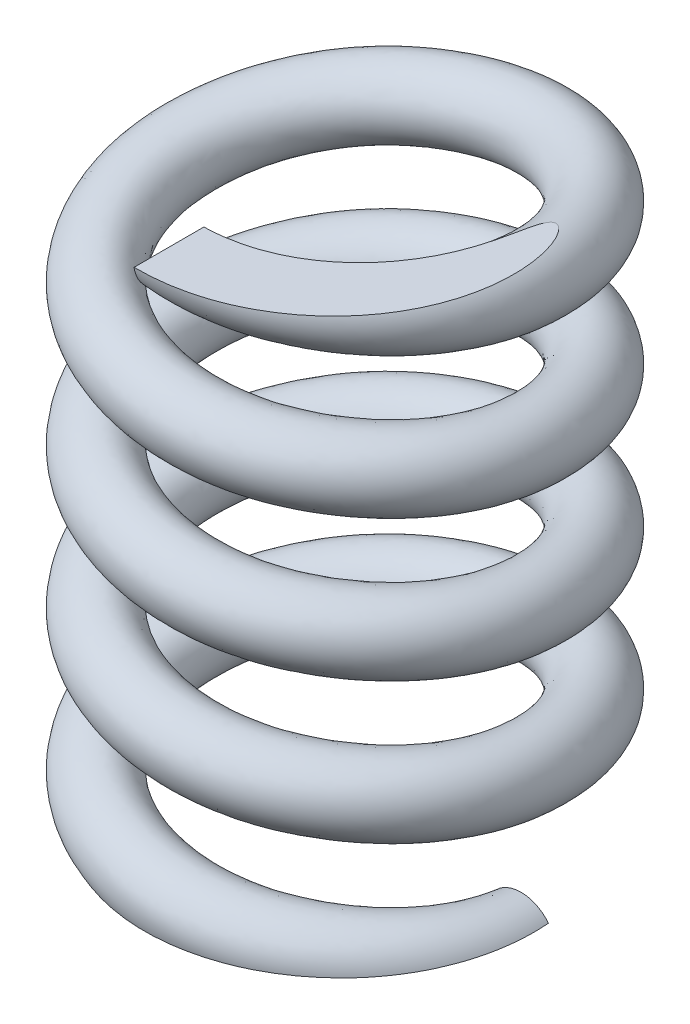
ISO-10303-21;
HEADER;
FILE_DESCRIPTION(('STEP AP214'),'2;1');
FILE_NAME('part.step','',(''),(''),'','','');
FILE_SCHEMA(('AUTOMOTIVE_DESIGN { 1 0 10303 214 1 1 1 1 }'));
ENDSEC;
DATA;
#1=APPLICATION_CONTEXT('core data for automotive mechanical design processes');
#2=APPLICATION_PROTOCOL_DEFINITION('international standard','automotive_design',2000,#1);
#3=PRODUCT_CONTEXT('',#1,'mechanical');
#4=PRODUCT('Part','Part','',(#3));
#5=PRODUCT_RELATED_PRODUCT_CATEGORY('part','',(#4));
#6=PRODUCT_DEFINITION_FORMATION('','',#4);
#7=PRODUCT_DEFINITION_CONTEXT('part definition',#1,'design');
#8=PRODUCT_DEFINITION('design','',#6,#7);
#9=PRODUCT_DEFINITION_SHAPE('','',#8);
#10=(LENGTH_UNIT() NAMED_UNIT(*) SI_UNIT(.MILLI.,.METRE.));
#11=(NAMED_UNIT(*) PLANE_ANGLE_UNIT() SI_UNIT($,.RADIAN.));
#12=(NAMED_UNIT(*) SI_UNIT($,.STERADIAN.) SOLID_ANGLE_UNIT());
#13=UNCERTAINTY_MEASURE_WITH_UNIT(LENGTH_MEASURE(1.E-05),#10,'distance_accuracy_value','');
#14=(GEOMETRIC_REPRESENTATION_CONTEXT(3) GLOBAL_UNCERTAINTY_ASSIGNED_CONTEXT((#13)) GLOBAL_UNIT_ASSIGNED_CONTEXT((#10,
#11,#12)) REPRESENTATION_CONTEXT('',''));
#15=CARTESIAN_POINT('',(0.,0.,0.));
#16=DIRECTION('',(0.,0.,1.));
#17=DIRECTION('',(1.,0.,0.));
#18=AXIS2_PLACEMENT_3D('',#15,#16,#17);
#19=CARTESIAN_POINT('',(2.5,0.,0.));
#20=DIRECTION('',(0.,0.,1.));
#21=DIRECTION('',(1.,0.,0.));
#22=AXIS2_PLACEMENT_3D('',#19,#20,#21);
#23=PLANE('',#22);
#24=CARTESIAN_POINT('',(2.5,0.,0.));
#25=DIRECTION('',(0.,0.,1.));
#26=DIRECTION('',(1.,0.,0.));
#27=AXIS2_PLACEMENT_3D('',#24,#25,#26);
#28=CIRCLE('',#27,0.5);
#29=CARTESIAN_POINT('',(2.88911017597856,0.313995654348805,0.));
#30=VERTEX_POINT('',#29);
#31=CARTESIAN_POINT('',(2.11088982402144,0.313995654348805,0.));
#32=VERTEX_POINT('',#31);
#33=EDGE_CURVE('E64',#30,#32,#28,.T.);
#34=ORIENTED_EDGE('',*,*,#33,.F.);
#35=DIRECTION('',(-1.,0.,0.));
#36=VECTOR('',#35,1.);
#37=CARTESIAN_POINT('',(2.5,0.313995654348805,0.));
#38=LINE('',#37,#36);
#39=EDGE_CURVE('E47',#30,#32,#38,.T.);
#40=ORIENTED_EDGE('',*,*,#39,.T.);
#41=EDGE_LOOP('',(#34,#40));
#42=FACE_BOUND('',#41,.T.);
#43=ADVANCED_FACE('F27',(#42),#23,.F.);
#44=CARTESIAN_POINT('',(-1.52828934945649E-13,8.5,2.5));
#45=DIRECTION('',(-1.,0.,0.));
#46=DIRECTION('',(0.,0.,1.));
#47=AXIS2_PLACEMENT_3D('',#44,#45,#46);
#48=PLANE('',#47);
#49=DIRECTION('',(0.,0.,1.));
#50=VECTOR('',#49,1.);
#51=CARTESIAN_POINT('',(-1.52828934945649E-13,8.43383346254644,2.5));
#52=LINE('',#51,#50);
#53=CARTESIAN_POINT('',(0.,8.43383346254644,2.00439734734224));
#54=VERTEX_POINT('',#53);
#55=CARTESIAN_POINT('',(-1.83125905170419E-13,8.43383346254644,2.99560265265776));
#56=VERTEX_POINT('',#55);
#57=EDGE_CURVE('E54',#54,#56,#52,.T.);
#58=ORIENTED_EDGE('',*,*,#57,.F.);
#59=CARTESIAN_POINT('',(-1.52828934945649E-13,8.5,2.5));
#60=DIRECTION('',(-1.,0.,0.));
#61=DIRECTION('',(0.,0.,1.));
#62=AXIS2_PLACEMENT_3D('',#59,#60,#61);
#63=CIRCLE('',#62,0.5);
#64=EDGE_CURVE('E67',#54,#56,#63,.T.);
#65=ORIENTED_EDGE('',*,*,#64,.T.);
#66=EDGE_LOOP('',(#58,#65));
#67=FACE_BOUND('',#66,.T.);
#68=ADVANCED_FACE('F82',(#67),#48,.T.);
#69=CARTESIAN_POINT('',(3.,0.,0.));
#70=CARTESIAN_POINT('',(3.,0.166666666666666,1.73205080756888));
#71=CARTESIAN_POINT('',(1.5,0.333333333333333,2.59807621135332));
#72=CARTESIAN_POINT('',(0.,0.499999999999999,3.46410161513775));
#73=CARTESIAN_POINT('',(-1.5,0.666666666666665,2.59807621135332));
#74=CARTESIAN_POINT('',(-3.,0.833333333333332,1.73205080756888));
#75=CARTESIAN_POINT('',(-3.,0.999999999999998,0.));
#76=CARTESIAN_POINT('',(-3.,1.16666666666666,-1.73205080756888));
#77=CARTESIAN_POINT('',(-1.5,1.33333333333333,-2.59807621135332));
#78=CARTESIAN_POINT('',(0.,1.5,-3.46410161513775));
#79=CARTESIAN_POINT('',(1.5,1.66666666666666,-2.59807621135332));
#80=CARTESIAN_POINT('',(3.,1.83333333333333,-1.73205080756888));
#81=CARTESIAN_POINT('',(3.,2.,0.));
#82=CARTESIAN_POINT('',(3.,2.16666666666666,1.73205080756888));
#83=CARTESIAN_POINT('',(1.5,2.33333333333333,2.59807621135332));
#84=CARTESIAN_POINT('',(0.,2.49999999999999,3.46410161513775));
#85=CARTESIAN_POINT('',(-1.5,2.66666666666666,2.59807621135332));
#86=CARTESIAN_POINT('',(-3.,2.83333333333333,1.73205080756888));
#87=CARTESIAN_POINT('',(-3.,2.99999999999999,0.));
#88=CARTESIAN_POINT('',(-3.,3.16666666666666,-1.73205080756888));
#89=CARTESIAN_POINT('',(-1.5,3.33333333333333,-2.59807621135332));
#90=CARTESIAN_POINT('',(0.,3.49999999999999,-3.46410161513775));
#91=CARTESIAN_POINT('',(1.5,3.66666666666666,-2.59807621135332));
#92=CARTESIAN_POINT('',(3.,3.83333333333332,-1.73205080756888));
#93=CARTESIAN_POINT('',(3.,3.99999999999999,0.));
#94=CARTESIAN_POINT('',(3.,4.16666666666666,1.73205080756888));
#95=CARTESIAN_POINT('',(1.5,4.33333333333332,2.59807621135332));
#96=CARTESIAN_POINT('',(0.,4.49999999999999,3.46410161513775));
#97=CARTESIAN_POINT('',(-1.5,4.66666666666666,2.59807621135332));
#98=CARTESIAN_POINT('',(-3.,4.83333333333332,1.73205080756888));
#99=CARTESIAN_POINT('',(-3.,4.99999999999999,0.));
#100=CARTESIAN_POINT('',(-3.,5.16666666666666,-1.73205080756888));
#101=CARTESIAN_POINT('',(-1.5,5.33333333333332,-2.59807621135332));
#102=CARTESIAN_POINT('',(0.,5.49999999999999,-3.46410161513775));
#103=CARTESIAN_POINT('',(1.5,5.66666666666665,-2.59807621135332));
#104=CARTESIAN_POINT('',(3.,5.83333333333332,-1.73205080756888));
#105=CARTESIAN_POINT('',(3.,5.99999999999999,0.));
#106=CARTESIAN_POINT('',(3.,6.16666666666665,1.73205080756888));
#107=CARTESIAN_POINT('',(1.5,6.33333333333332,2.59807621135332));
#108=CARTESIAN_POINT('',(0.,6.49999999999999,3.46410161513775));
#109=CARTESIAN_POINT('',(-1.5,6.66666666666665,2.59807621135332));
#110=CARTESIAN_POINT('',(-3.,6.83333333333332,1.73205080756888));
#111=CARTESIAN_POINT('',(-3.,6.99999999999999,0.));
#112=CARTESIAN_POINT('',(-3.,7.16666666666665,-1.73205080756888));
#113=CARTESIAN_POINT('',(-1.5,7.33333333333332,-2.59807621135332));
#114=CARTESIAN_POINT('',(0.,7.49999999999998,-3.46410161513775));
#115=CARTESIAN_POINT('',(1.5,7.66666666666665,-2.59807621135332));
#116=CARTESIAN_POINT('',(3.,7.83333333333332,-1.73205080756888));
#117=CARTESIAN_POINT('',(3.,7.99999999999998,0.));
#118=CARTESIAN_POINT('',(3.,8.16666666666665,1.73205080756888));
#119=CARTESIAN_POINT('',(1.5,8.33333333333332,2.59807621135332));
#120=CARTESIAN_POINT('',(0.,8.49999999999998,3.46410161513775));
#121=CARTESIAN_POINT('',(-1.5,8.66666666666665,2.59807621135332));
#122=CARTESIAN_POINT('',(-3.,8.83333333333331,1.73205080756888));
#123=CARTESIAN_POINT('',(-3.,8.99999999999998,0.));
#124=CARTESIAN_POINT('',(-3.,9.16666666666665,-1.73205080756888));
#125=CARTESIAN_POINT('',(-1.5,9.33333333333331,-2.59807621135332));
#126=CARTESIAN_POINT('',(0.,9.49999999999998,-3.46410161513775));
#127=CARTESIAN_POINT('',(1.5,9.66666666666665,-2.59807621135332));
#128=CARTESIAN_POINT('',(3.,9.83333333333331,-1.73205080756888));
#129=CARTESIAN_POINT('',(3.,9.99999999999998,0.));
#130=CARTESIAN_POINT('',(3.,1.,0.));
#131=CARTESIAN_POINT('',(3.,1.16666666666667,1.73205080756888));
#132=CARTESIAN_POINT('',(1.5,1.33333333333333,2.59807621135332));
#133=CARTESIAN_POINT('',(0.,1.5,3.46410161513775));
#134=CARTESIAN_POINT('',(-1.5,1.66666666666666,2.59807621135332));
#135=CARTESIAN_POINT('',(-3.,1.83333333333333,1.73205080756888));
#136=CARTESIAN_POINT('',(-3.,2.,0.));
#137=CARTESIAN_POINT('',(-3.,2.16666666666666,-1.73205080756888));
#138=CARTESIAN_POINT('',(-1.5,2.33333333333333,-2.59807621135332));
#139=CARTESIAN_POINT('',(0.,2.5,-3.46410161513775));
#140=CARTESIAN_POINT('',(1.5,2.66666666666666,-2.59807621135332));
#141=CARTESIAN_POINT('',(3.,2.83333333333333,-1.73205080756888));
#142=CARTESIAN_POINT('',(3.,3.,0.));
#143=CARTESIAN_POINT('',(3.,3.16666666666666,1.73205080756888));
#144=CARTESIAN_POINT('',(1.5,3.33333333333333,2.59807621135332));
#145=CARTESIAN_POINT('',(0.,3.49999999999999,3.46410161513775));
#146=CARTESIAN_POINT('',(-1.5,3.66666666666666,2.59807621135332));
#147=CARTESIAN_POINT('',(-3.,3.83333333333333,1.73205080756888));
#148=CARTESIAN_POINT('',(-3.,3.99999999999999,0.));
#149=CARTESIAN_POINT('',(-3.,4.16666666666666,-1.73205080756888));
#150=CARTESIAN_POINT('',(-1.5,4.33333333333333,-2.59807621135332));
#151=CARTESIAN_POINT('',(0.,4.49999999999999,-3.46410161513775));
#152=CARTESIAN_POINT('',(1.5,4.66666666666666,-2.59807621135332));
#153=CARTESIAN_POINT('',(3.,4.83333333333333,-1.73205080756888));
#154=CARTESIAN_POINT('',(3.,4.99999999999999,0.));
#155=CARTESIAN_POINT('',(3.,5.16666666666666,1.73205080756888));
#156=CARTESIAN_POINT('',(1.5,5.33333333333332,2.59807621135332));
#157=CARTESIAN_POINT('',(0.,5.49999999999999,3.46410161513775));
#158=CARTESIAN_POINT('',(-1.5,5.66666666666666,2.59807621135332));
#159=CARTESIAN_POINT('',(-3.,5.83333333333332,1.73205080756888));
#160=CARTESIAN_POINT('',(-3.,5.99999999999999,0.));
#161=CARTESIAN_POINT('',(-3.,6.16666666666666,-1.73205080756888));
#162=CARTESIAN_POINT('',(-1.5,6.33333333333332,-2.59807621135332));
#163=CARTESIAN_POINT('',(0.,6.49999999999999,-3.46410161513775));
#164=CARTESIAN_POINT('',(1.5,6.66666666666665,-2.59807621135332));
#165=CARTESIAN_POINT('',(3.,6.83333333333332,-1.73205080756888));
#166=CARTESIAN_POINT('',(3.,6.99999999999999,0.));
#167=CARTESIAN_POINT('',(3.,7.16666666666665,1.73205080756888));
#168=CARTESIAN_POINT('',(1.5,7.33333333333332,2.59807621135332));
#169=CARTESIAN_POINT('',(0.,7.49999999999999,3.46410161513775));
#170=CARTESIAN_POINT('',(-1.5,7.66666666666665,2.59807621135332));
#171=CARTESIAN_POINT('',(-3.,7.83333333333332,1.73205080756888));
#172=CARTESIAN_POINT('',(-3.,7.99999999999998,0.));
#173=CARTESIAN_POINT('',(-3.,8.16666666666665,-1.73205080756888));
#174=CARTESIAN_POINT('',(-1.5,8.33333333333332,-2.59807621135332));
#175=CARTESIAN_POINT('',(0.,8.49999999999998,-3.46410161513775));
#176=CARTESIAN_POINT('',(1.5,8.66666666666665,-2.59807621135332));
#177=CARTESIAN_POINT('',(3.,8.83333333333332,-1.73205080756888));
#178=CARTESIAN_POINT('',(3.,8.99999999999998,0.));
#179=CARTESIAN_POINT('',(3.,9.16666666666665,1.73205080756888));
#180=CARTESIAN_POINT('',(1.5,9.33333333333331,2.59807621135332));
#181=CARTESIAN_POINT('',(0.,9.49999999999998,3.46410161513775));
#182=CARTESIAN_POINT('',(-1.5,9.66666666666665,2.59807621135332));
#183=CARTESIAN_POINT('',(-3.,9.83333333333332,1.73205080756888));
#184=CARTESIAN_POINT('',(-3.,9.99999999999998,0.));
#185=CARTESIAN_POINT('',(-3.,10.1666666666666,-1.73205080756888));
#186=CARTESIAN_POINT('',(-1.5,10.3333333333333,-2.59807621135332));
#187=CARTESIAN_POINT('',(0.,10.5,-3.46410161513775));
#188=CARTESIAN_POINT('',(1.5,10.6666666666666,-2.59807621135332));
#189=CARTESIAN_POINT('',(3.,10.8333333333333,-1.73205080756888));
#190=CARTESIAN_POINT('',(3.,11.,0.));
#191=CARTESIAN_POINT('',(2.,1.,0.));
#192=CARTESIAN_POINT('',(2.,1.16666666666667,1.15470053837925));
#193=CARTESIAN_POINT('',(1.,1.33333333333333,1.73205080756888));
#194=CARTESIAN_POINT('',(0.,1.5,2.3094010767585));
#195=CARTESIAN_POINT('',(-1.,1.66666666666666,1.73205080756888));
#196=CARTESIAN_POINT('',(-2.,1.83333333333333,1.15470053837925));
#197=CARTESIAN_POINT('',(-2.,2.,0.));
#198=CARTESIAN_POINT('',(-2.,2.16666666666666,-1.15470053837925));
#199=CARTESIAN_POINT('',(-1.,2.33333333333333,-1.73205080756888));
#200=CARTESIAN_POINT('',(0.,2.5,-2.3094010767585));
#201=CARTESIAN_POINT('',(0.999999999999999,2.66666666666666,-1.73205080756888));
#202=CARTESIAN_POINT('',(2.,2.83333333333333,-1.15470053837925));
#203=CARTESIAN_POINT('',(2.,3.,0.));
#204=CARTESIAN_POINT('',(2.,3.16666666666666,1.15470053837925));
#205=CARTESIAN_POINT('',(1.,3.33333333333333,1.73205080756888));
#206=CARTESIAN_POINT('',(0.,3.49999999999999,2.3094010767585));
#207=CARTESIAN_POINT('',(-1.,3.66666666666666,1.73205080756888));
#208=CARTESIAN_POINT('',(-2.,3.83333333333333,1.15470053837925));
#209=CARTESIAN_POINT('',(-2.,3.99999999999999,0.));
#210=CARTESIAN_POINT('',(-2.,4.16666666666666,-1.15470053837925));
#211=CARTESIAN_POINT('',(-1.,4.33333333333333,-1.73205080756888));
#212=CARTESIAN_POINT('',(0.,4.49999999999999,-2.3094010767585));
#213=CARTESIAN_POINT('',(0.999999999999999,4.66666666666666,-1.73205080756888));
#214=CARTESIAN_POINT('',(2.,4.83333333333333,-1.15470053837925));
#215=CARTESIAN_POINT('',(2.,4.99999999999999,0.));
#216=CARTESIAN_POINT('',(2.,5.16666666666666,1.15470053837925));
#217=CARTESIAN_POINT('',(1.,5.33333333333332,1.73205080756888));
#218=CARTESIAN_POINT('',(0.,5.49999999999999,2.3094010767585));
#219=CARTESIAN_POINT('',(-1.,5.66666666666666,1.73205080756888));
#220=CARTESIAN_POINT('',(-2.,5.83333333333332,1.15470053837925));
#221=CARTESIAN_POINT('',(-2.,5.99999999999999,0.));
#222=CARTESIAN_POINT('',(-2.,6.16666666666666,-1.15470053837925));
#223=CARTESIAN_POINT('',(-1.,6.33333333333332,-1.73205080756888));
#224=CARTESIAN_POINT('',(0.,6.49999999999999,-2.3094010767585));
#225=CARTESIAN_POINT('',(0.999999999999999,6.66666666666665,-1.73205080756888));
#226=CARTESIAN_POINT('',(2.,6.83333333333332,-1.15470053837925));
#227=CARTESIAN_POINT('',(2.,6.99999999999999,0.));
#228=CARTESIAN_POINT('',(2.,7.16666666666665,1.15470053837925));
#229=CARTESIAN_POINT('',(1.,7.33333333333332,1.73205080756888));
#230=CARTESIAN_POINT('',(0.,7.49999999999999,2.3094010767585));
#231=CARTESIAN_POINT('',(-1.,7.66666666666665,1.73205080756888));
#232=CARTESIAN_POINT('',(-2.,7.83333333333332,1.15470053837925));
#233=CARTESIAN_POINT('',(-2.,7.99999999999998,0.));
#234=CARTESIAN_POINT('',(-2.,8.16666666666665,-1.15470053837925));
#235=CARTESIAN_POINT('',(-1.,8.33333333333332,-1.73205080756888));
#236=CARTESIAN_POINT('',(0.,8.49999999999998,-2.3094010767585));
#237=CARTESIAN_POINT('',(0.999999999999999,8.66666666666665,-1.73205080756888));
#238=CARTESIAN_POINT('',(2.,8.83333333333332,-1.15470053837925));
#239=CARTESIAN_POINT('',(2.,8.99999999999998,0.));
#240=CARTESIAN_POINT('',(2.,9.16666666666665,1.15470053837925));
#241=CARTESIAN_POINT('',(1.,9.33333333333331,1.73205080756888));
#242=CARTESIAN_POINT('',(0.,9.49999999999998,2.3094010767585));
#243=CARTESIAN_POINT('',(-1.,9.66666666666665,1.73205080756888));
#244=CARTESIAN_POINT('',(-2.,9.83333333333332,1.15470053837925));
#245=CARTESIAN_POINT('',(-2.,9.99999999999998,0.));
#246=CARTESIAN_POINT('',(-2.,10.1666666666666,-1.15470053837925));
#247=CARTESIAN_POINT('',(-1.,10.3333333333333,-1.73205080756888));
#248=CARTESIAN_POINT('',(0.,10.5,-2.3094010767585));
#249=CARTESIAN_POINT('',(0.999999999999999,10.6666666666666,-1.73205080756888));
#250=CARTESIAN_POINT('',(2.,10.8333333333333,-1.15470053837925));
#251=CARTESIAN_POINT('',(2.,11.,0.));
#252=CARTESIAN_POINT('',(2.,0.,0.));
#253=CARTESIAN_POINT('',(2.,0.166666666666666,1.15470053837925));
#254=CARTESIAN_POINT('',(1.,0.333333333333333,1.73205080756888));
#255=CARTESIAN_POINT('',(0.,0.499999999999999,2.3094010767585));
#256=CARTESIAN_POINT('',(-1.,0.666666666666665,1.73205080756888));
#257=CARTESIAN_POINT('',(-2.,0.833333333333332,1.15470053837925));
#258=CARTESIAN_POINT('',(-2.,0.999999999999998,0.));
#259=CARTESIAN_POINT('',(-2.,1.16666666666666,-1.15470053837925));
#260=CARTESIAN_POINT('',(-1.,1.33333333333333,-1.73205080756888));
#261=CARTESIAN_POINT('',(0.,1.5,-2.3094010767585));
#262=CARTESIAN_POINT('',(0.999999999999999,1.66666666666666,-1.73205080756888));
#263=CARTESIAN_POINT('',(2.,1.83333333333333,-1.15470053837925));
#264=CARTESIAN_POINT('',(2.,2.,0.));
#265=CARTESIAN_POINT('',(2.,2.16666666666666,1.15470053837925));
#266=CARTESIAN_POINT('',(1.,2.33333333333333,1.73205080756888));
#267=CARTESIAN_POINT('',(0.,2.49999999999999,2.3094010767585));
#268=CARTESIAN_POINT('',(-1.,2.66666666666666,1.73205080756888));
#269=CARTESIAN_POINT('',(-2.,2.83333333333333,1.15470053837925));
#270=CARTESIAN_POINT('',(-2.,2.99999999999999,0.));
#271=CARTESIAN_POINT('',(-2.,3.16666666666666,-1.15470053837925));
#272=CARTESIAN_POINT('',(-1.,3.33333333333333,-1.73205080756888));
#273=CARTESIAN_POINT('',(0.,3.49999999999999,-2.3094010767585));
#274=CARTESIAN_POINT('',(0.999999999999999,3.66666666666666,-1.73205080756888));
#275=CARTESIAN_POINT('',(2.,3.83333333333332,-1.15470053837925));
#276=CARTESIAN_POINT('',(2.,3.99999999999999,0.));
#277=CARTESIAN_POINT('',(2.,4.16666666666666,1.15470053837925));
#278=CARTESIAN_POINT('',(1.,4.33333333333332,1.73205080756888));
#279=CARTESIAN_POINT('',(0.,4.49999999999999,2.3094010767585));
#280=CARTESIAN_POINT('',(-1.,4.66666666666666,1.73205080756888));
#281=CARTESIAN_POINT('',(-2.,4.83333333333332,1.15470053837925));
#282=CARTESIAN_POINT('',(-2.,4.99999999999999,0.));
#283=CARTESIAN_POINT('',(-2.,5.16666666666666,-1.15470053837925));
#284=CARTESIAN_POINT('',(-1.,5.33333333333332,-1.73205080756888));
#285=CARTESIAN_POINT('',(0.,5.49999999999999,-2.3094010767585));
#286=CARTESIAN_POINT('',(0.999999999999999,5.66666666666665,-1.73205080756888));
#287=CARTESIAN_POINT('',(2.,5.83333333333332,-1.15470053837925));
#288=CARTESIAN_POINT('',(2.,5.99999999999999,0.));
#289=CARTESIAN_POINT('',(2.,6.16666666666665,1.15470053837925));
#290=CARTESIAN_POINT('',(1.,6.33333333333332,1.73205080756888));
#291=CARTESIAN_POINT('',(0.,6.49999999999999,2.3094010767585));
#292=CARTESIAN_POINT('',(-1.,6.66666666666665,1.73205080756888));
#293=CARTESIAN_POINT('',(-2.,6.83333333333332,1.15470053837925));
#294=CARTESIAN_POINT('',(-2.,6.99999999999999,0.));
#295=CARTESIAN_POINT('',(-2.,7.16666666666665,-1.15470053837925));
#296=CARTESIAN_POINT('',(-1.,7.33333333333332,-1.73205080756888));
#297=CARTESIAN_POINT('',(0.,7.49999999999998,-2.3094010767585));
#298=CARTESIAN_POINT('',(0.999999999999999,7.66666666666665,-1.73205080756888));
#299=CARTESIAN_POINT('',(2.,7.83333333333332,-1.15470053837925));
#300=CARTESIAN_POINT('',(2.,7.99999999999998,0.));
#301=CARTESIAN_POINT('',(2.,8.16666666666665,1.15470053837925));
#302=CARTESIAN_POINT('',(1.,8.33333333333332,1.73205080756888));
#303=CARTESIAN_POINT('',(0.,8.49999999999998,2.3094010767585));
#304=CARTESIAN_POINT('',(-1.,8.66666666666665,1.73205080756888));
#305=CARTESIAN_POINT('',(-2.,8.83333333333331,1.15470053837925));
#306=CARTESIAN_POINT('',(-2.,8.99999999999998,0.));
#307=CARTESIAN_POINT('',(-2.,9.16666666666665,-1.15470053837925));
#308=CARTESIAN_POINT('',(-1.,9.33333333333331,-1.73205080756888));
#309=CARTESIAN_POINT('',(0.,9.49999999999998,-2.3094010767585));
#310=CARTESIAN_POINT('',(0.999999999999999,9.66666666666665,-1.73205080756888));
#311=CARTESIAN_POINT('',(2.,9.83333333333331,-1.15470053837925));
#312=CARTESIAN_POINT('',(2.,9.99999999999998,0.));
#313=CARTESIAN_POINT('',(2.,-1.,0.));
#314=CARTESIAN_POINT('',(2.,-0.833333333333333,1.15470053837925));
#315=CARTESIAN_POINT('',(1.,-0.666666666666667,1.73205080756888));
#316=CARTESIAN_POINT('',(0.,-0.500000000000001,2.3094010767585));
#317=CARTESIAN_POINT('',(-1.,-0.333333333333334,1.73205080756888));
#318=CARTESIAN_POINT('',(-2.,-0.166666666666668,1.15470053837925));
#319=CARTESIAN_POINT('',(-2.,0.,0.));
#320=CARTESIAN_POINT('',(-2.,0.166666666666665,-1.15470053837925));
#321=CARTESIAN_POINT('',(-1.,0.333333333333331,-1.73205080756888));
#322=CARTESIAN_POINT('',(0.,0.499999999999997,-2.3094010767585));
#323=CARTESIAN_POINT('',(0.999999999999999,0.666666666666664,-1.73205080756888));
#324=CARTESIAN_POINT('',(2.,0.83333333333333,-1.15470053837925));
#325=CARTESIAN_POINT('',(2.,0.999999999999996,0.));
#326=CARTESIAN_POINT('',(2.,1.16666666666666,1.15470053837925));
#327=CARTESIAN_POINT('',(1.,1.33333333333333,1.73205080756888));
#328=CARTESIAN_POINT('',(0.,1.5,2.3094010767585));
#329=CARTESIAN_POINT('',(-1.,1.66666666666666,1.73205080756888));
#330=CARTESIAN_POINT('',(-2.,1.83333333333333,1.15470053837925));
#331=CARTESIAN_POINT('',(-2.,1.99999999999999,0.));
#332=CARTESIAN_POINT('',(-2.,2.16666666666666,-1.15470053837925));
#333=CARTESIAN_POINT('',(-1.,2.33333333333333,-1.73205080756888));
#334=CARTESIAN_POINT('',(0.,2.49999999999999,-2.3094010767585));
#335=CARTESIAN_POINT('',(0.999999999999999,2.66666666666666,-1.73205080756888));
#336=CARTESIAN_POINT('',(2.,2.83333333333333,-1.15470053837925));
#337=CARTESIAN_POINT('',(2.,2.99999999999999,0.));
#338=CARTESIAN_POINT('',(2.,3.16666666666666,1.15470053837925));
#339=CARTESIAN_POINT('',(1.,3.33333333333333,1.73205080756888));
#340=CARTESIAN_POINT('',(0.,3.49999999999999,2.3094010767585));
#341=CARTESIAN_POINT('',(-1.,3.66666666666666,1.73205080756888));
#342=CARTESIAN_POINT('',(-2.,3.83333333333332,1.15470053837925));
#343=CARTESIAN_POINT('',(-2.,3.99999999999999,0.));
#344=CARTESIAN_POINT('',(-2.,4.16666666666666,-1.15470053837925));
#345=CARTESIAN_POINT('',(-1.,4.33333333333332,-1.73205080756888));
#346=CARTESIAN_POINT('',(0.,4.49999999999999,-2.3094010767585));
#347=CARTESIAN_POINT('',(0.999999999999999,4.66666666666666,-1.73205080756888));
#348=CARTESIAN_POINT('',(2.,4.83333333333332,-1.15470053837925));
#349=CARTESIAN_POINT('',(2.,4.99999999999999,0.));
#350=CARTESIAN_POINT('',(2.,5.16666666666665,1.15470053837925));
#351=CARTESIAN_POINT('',(1.,5.33333333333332,1.73205080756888));
#352=CARTESIAN_POINT('',(0.,5.49999999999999,2.3094010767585));
#353=CARTESIAN_POINT('',(-1.,5.66666666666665,1.73205080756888));
#354=CARTESIAN_POINT('',(-2.,5.83333333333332,1.15470053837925));
#355=CARTESIAN_POINT('',(-2.,5.99999999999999,0.));
#356=CARTESIAN_POINT('',(-2.,6.16666666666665,-1.15470053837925));
#357=CARTESIAN_POINT('',(-1.,6.33333333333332,-1.73205080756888));
#358=CARTESIAN_POINT('',(0.,6.49999999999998,-2.3094010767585));
#359=CARTESIAN_POINT('',(0.999999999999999,6.66666666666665,-1.73205080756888));
#360=CARTESIAN_POINT('',(2.,6.83333333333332,-1.15470053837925));
#361=CARTESIAN_POINT('',(2.,6.99999999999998,0.));
#362=CARTESIAN_POINT('',(2.,7.16666666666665,1.15470053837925));
#363=CARTESIAN_POINT('',(1.,7.33333333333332,1.73205080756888));
#364=CARTESIAN_POINT('',(0.,7.49999999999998,2.3094010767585));
#365=CARTESIAN_POINT('',(-1.,7.66666666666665,1.73205080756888));
#366=CARTESIAN_POINT('',(-2.,7.83333333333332,1.15470053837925));
#367=CARTESIAN_POINT('',(-2.,7.99999999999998,0.));
#368=CARTESIAN_POINT('',(-2.,8.16666666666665,-1.15470053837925));
#369=CARTESIAN_POINT('',(-1.,8.33333333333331,-1.73205080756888));
#370=CARTESIAN_POINT('',(0.,8.49999999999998,-2.3094010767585));
#371=CARTESIAN_POINT('',(0.999999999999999,8.66666666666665,-1.73205080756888));
#372=CARTESIAN_POINT('',(2.,8.83333333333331,-1.15470053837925));
#373=CARTESIAN_POINT('',(2.,8.99999999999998,0.));
#374=CARTESIAN_POINT('',(3.,-1.,0.));
#375=CARTESIAN_POINT('',(3.,-0.833333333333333,1.73205080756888));
#376=CARTESIAN_POINT('',(1.5,-0.666666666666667,2.59807621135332));
#377=CARTESIAN_POINT('',(0.,-0.500000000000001,3.46410161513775));
#378=CARTESIAN_POINT('',(-1.5,-0.333333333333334,2.59807621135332));
#379=CARTESIAN_POINT('',(-3.,-0.166666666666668,1.73205080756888));
#380=CARTESIAN_POINT('',(-3.,0.,0.));
#381=CARTESIAN_POINT('',(-3.,0.166666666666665,-1.73205080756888));
#382=CARTESIAN_POINT('',(-1.5,0.333333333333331,-2.59807621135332));
#383=CARTESIAN_POINT('',(0.,0.499999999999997,-3.46410161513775));
#384=CARTESIAN_POINT('',(1.5,0.666666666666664,-2.59807621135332));
#385=CARTESIAN_POINT('',(3.,0.83333333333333,-1.73205080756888));
#386=CARTESIAN_POINT('',(3.,0.999999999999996,0.));
#387=CARTESIAN_POINT('',(3.,1.16666666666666,1.73205080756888));
#388=CARTESIAN_POINT('',(1.5,1.33333333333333,2.59807621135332));
#389=CARTESIAN_POINT('',(0.,1.5,3.46410161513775));
#390=CARTESIAN_POINT('',(-1.5,1.66666666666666,2.59807621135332));
#391=CARTESIAN_POINT('',(-3.,1.83333333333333,1.73205080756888));
#392=CARTESIAN_POINT('',(-3.,1.99999999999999,0.));
#393=CARTESIAN_POINT('',(-3.,2.16666666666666,-1.73205080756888));
#394=CARTESIAN_POINT('',(-1.5,2.33333333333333,-2.59807621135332));
#395=CARTESIAN_POINT('',(0.,2.49999999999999,-3.46410161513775));
#396=CARTESIAN_POINT('',(1.5,2.66666666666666,-2.59807621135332));
#397=CARTESIAN_POINT('',(3.,2.83333333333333,-1.73205080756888));
#398=CARTESIAN_POINT('',(3.,2.99999999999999,0.));
#399=CARTESIAN_POINT('',(3.,3.16666666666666,1.73205080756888));
#400=CARTESIAN_POINT('',(1.5,3.33333333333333,2.59807621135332));
#401=CARTESIAN_POINT('',(0.,3.49999999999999,3.46410161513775));
#402=CARTESIAN_POINT('',(-1.5,3.66666666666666,2.59807621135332));
#403=CARTESIAN_POINT('',(-3.,3.83333333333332,1.73205080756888));
#404=CARTESIAN_POINT('',(-3.,3.99999999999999,0.));
#405=CARTESIAN_POINT('',(-3.,4.16666666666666,-1.73205080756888));
#406=CARTESIAN_POINT('',(-1.5,4.33333333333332,-2.59807621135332));
#407=CARTESIAN_POINT('',(0.,4.49999999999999,-3.46410161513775));
#408=CARTESIAN_POINT('',(1.5,4.66666666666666,-2.59807621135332));
#409=CARTESIAN_POINT('',(3.,4.83333333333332,-1.73205080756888));
#410=CARTESIAN_POINT('',(3.,4.99999999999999,0.));
#411=CARTESIAN_POINT('',(3.,5.16666666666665,1.73205080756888));
#412=CARTESIAN_POINT('',(1.5,5.33333333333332,2.59807621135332));
#413=CARTESIAN_POINT('',(0.,5.49999999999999,3.46410161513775));
#414=CARTESIAN_POINT('',(-1.5,5.66666666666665,2.59807621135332));
#415=CARTESIAN_POINT('',(-3.,5.83333333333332,1.73205080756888));
#416=CARTESIAN_POINT('',(-3.,5.99999999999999,0.));
#417=CARTESIAN_POINT('',(-3.,6.16666666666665,-1.73205080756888));
#418=CARTESIAN_POINT('',(-1.5,6.33333333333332,-2.59807621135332));
#419=CARTESIAN_POINT('',(0.,6.49999999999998,-3.46410161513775));
#420=CARTESIAN_POINT('',(1.5,6.66666666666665,-2.59807621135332));
#421=CARTESIAN_POINT('',(3.,6.83333333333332,-1.73205080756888));
#422=CARTESIAN_POINT('',(3.,6.99999999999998,0.));
#423=CARTESIAN_POINT('',(3.,7.16666666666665,1.73205080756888));
#424=CARTESIAN_POINT('',(1.5,7.33333333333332,2.59807621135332));
#425=CARTESIAN_POINT('',(0.,7.49999999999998,3.46410161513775));
#426=CARTESIAN_POINT('',(-1.5,7.66666666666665,2.59807621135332));
#427=CARTESIAN_POINT('',(-3.,7.83333333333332,1.73205080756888));
#428=CARTESIAN_POINT('',(-3.,7.99999999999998,0.));
#429=CARTESIAN_POINT('',(-3.,8.16666666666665,-1.73205080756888));
#430=CARTESIAN_POINT('',(-1.5,8.33333333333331,-2.59807621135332));
#431=CARTESIAN_POINT('',(0.,8.49999999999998,-3.46410161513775));
#432=CARTESIAN_POINT('',(1.5,8.66666666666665,-2.59807621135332));
#433=CARTESIAN_POINT('',(3.,8.83333333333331,-1.73205080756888));
#434=CARTESIAN_POINT('',(3.,8.99999999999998,0.));
#435=CARTESIAN_POINT('',(3.,0.,0.));
#436=CARTESIAN_POINT('',(3.,0.166666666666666,1.73205080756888));
#437=CARTESIAN_POINT('',(1.5,0.333333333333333,2.59807621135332));
#438=CARTESIAN_POINT('',(0.,0.499999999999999,3.46410161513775));
#439=CARTESIAN_POINT('',(-1.5,0.666666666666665,2.59807621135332));
#440=CARTESIAN_POINT('',(-3.,0.833333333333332,1.73205080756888));
#441=CARTESIAN_POINT('',(-3.,0.999999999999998,0.));
#442=CARTESIAN_POINT('',(-3.,1.16666666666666,-1.73205080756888));
#443=CARTESIAN_POINT('',(-1.5,1.33333333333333,-2.59807621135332));
#444=CARTESIAN_POINT('',(0.,1.5,-3.46410161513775));
#445=CARTESIAN_POINT('',(1.5,1.66666666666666,-2.59807621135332));
#446=CARTESIAN_POINT('',(3.,1.83333333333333,-1.73205080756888));
#447=CARTESIAN_POINT('',(3.,2.,0.));
#448=CARTESIAN_POINT('',(3.,2.16666666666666,1.73205080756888));
#449=CARTESIAN_POINT('',(1.5,2.33333333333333,2.59807621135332));
#450=CARTESIAN_POINT('',(0.,2.49999999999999,3.46410161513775));
#451=CARTESIAN_POINT('',(-1.5,2.66666666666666,2.59807621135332));
#452=CARTESIAN_POINT('',(-3.,2.83333333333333,1.73205080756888));
#453=CARTESIAN_POINT('',(-3.,2.99999999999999,0.));
#454=CARTESIAN_POINT('',(-3.,3.16666666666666,-1.73205080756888));
#455=CARTESIAN_POINT('',(-1.5,3.33333333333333,-2.59807621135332));
#456=CARTESIAN_POINT('',(0.,3.49999999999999,-3.46410161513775));
#457=CARTESIAN_POINT('',(1.5,3.66666666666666,-2.59807621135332));
#458=CARTESIAN_POINT('',(3.,3.83333333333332,-1.73205080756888));
#459=CARTESIAN_POINT('',(3.,3.99999999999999,0.));
#460=CARTESIAN_POINT('',(3.,4.16666666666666,1.73205080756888));
#461=CARTESIAN_POINT('',(1.5,4.33333333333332,2.59807621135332));
#462=CARTESIAN_POINT('',(0.,4.49999999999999,3.46410161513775));
#463=CARTESIAN_POINT('',(-1.5,4.66666666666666,2.59807621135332));
#464=CARTESIAN_POINT('',(-3.,4.83333333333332,1.73205080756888));
#465=CARTESIAN_POINT('',(-3.,4.99999999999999,0.));
#466=CARTESIAN_POINT('',(-3.,5.16666666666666,-1.73205080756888));
#467=CARTESIAN_POINT('',(-1.5,5.33333333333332,-2.59807621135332));
#468=CARTESIAN_POINT('',(0.,5.49999999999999,-3.46410161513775));
#469=CARTESIAN_POINT('',(1.5,5.66666666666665,-2.59807621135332));
#470=CARTESIAN_POINT('',(3.,5.83333333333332,-1.73205080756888));
#471=CARTESIAN_POINT('',(3.,5.99999999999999,0.));
#472=CARTESIAN_POINT('',(3.,6.16666666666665,1.73205080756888));
#473=CARTESIAN_POINT('',(1.5,6.33333333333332,2.59807621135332));
#474=CARTESIAN_POINT('',(0.,6.49999999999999,3.46410161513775));
#475=CARTESIAN_POINT('',(-1.5,6.66666666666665,2.59807621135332));
#476=CARTESIAN_POINT('',(-3.,6.83333333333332,1.73205080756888));
#477=CARTESIAN_POINT('',(-3.,6.99999999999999,0.));
#478=CARTESIAN_POINT('',(-3.,7.16666666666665,-1.73205080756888));
#479=CARTESIAN_POINT('',(-1.5,7.33333333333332,-2.59807621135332));
#480=CARTESIAN_POINT('',(0.,7.49999999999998,-3.46410161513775));
#481=CARTESIAN_POINT('',(1.5,7.66666666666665,-2.59807621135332));
#482=CARTESIAN_POINT('',(3.,7.83333333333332,-1.73205080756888));
#483=CARTESIAN_POINT('',(3.,7.99999999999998,0.));
#484=CARTESIAN_POINT('',(3.,8.16666666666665,1.73205080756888));
#485=CARTESIAN_POINT('',(1.5,8.33333333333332,2.59807621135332));
#486=CARTESIAN_POINT('',(0.,8.49999999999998,3.46410161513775));
#487=CARTESIAN_POINT('',(-1.5,8.66666666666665,2.59807621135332));
#488=CARTESIAN_POINT('',(-3.,8.83333333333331,1.73205080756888));
#489=CARTESIAN_POINT('',(-3.,8.99999999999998,0.));
#490=CARTESIAN_POINT('',(-3.,9.16666666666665,-1.73205080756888));
#491=CARTESIAN_POINT('',(-1.5,9.33333333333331,-2.59807621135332));
#492=CARTESIAN_POINT('',(0.,9.49999999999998,-3.46410161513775));
#493=CARTESIAN_POINT('',(1.5,9.66666666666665,-2.59807621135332));
#494=CARTESIAN_POINT('',(3.,9.83333333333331,-1.73205080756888));
#495=CARTESIAN_POINT('',(3.,9.99999999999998,0.));
#496=(BOUNDED_SURFACE() B_SPLINE_SURFACE(3,2,((#69,#70,#71,#72,#73,#74,#75,#76,#77,#78,#79,#80,
#81,#82,#83,#84,#85,#86,#87,#88,#89,#90,#91,#92,#93,#94,#95,#96,#97,#98,#99,#100,#101,#102,#103,
#104,#105,#106,#107,#108,#109,#110,#111,#112,#113,#114,#115,#116,#117,#118,#119,#120,#121,#122,
#123,#124,#125,#126,#127,#128,#129),(#130,#131,#132,#133,#134,#135,#136,#137,#138,#139,#140,
#141,#142,#143,#144,#145,#146,#147,#148,#149,#150,#151,#152,#153,#154,#155,#156,#157,#158,#159,
#160,#161,#162,#163,#164,#165,#166,#167,#168,#169,#170,#171,#172,#173,#174,#175,#176,#177,#178,
#179,#180,#181,#182,#183,#184,#185,#186,#187,#188,#189,#190),(#191,#192,#193,#194,#195,#196,
#197,#198,#199,#200,#201,#202,#203,#204,#205,#206,#207,#208,#209,#210,#211,#212,#213,#214,#215,
#216,#217,#218,#219,#220,#221,#222,#223,#224,#225,#226,#227,#228,#229,#230,#231,#232,#233,#234,
#235,#236,#237,#238,#239,#240,#241,#242,#243,#244,#245,#246,#247,#248,#249,#250,#251),(#252,
#253,#254,#255,#256,#257,#258,#259,#260,#261,#262,#263,#264,#265,#266,#267,#268,#269,#270,#271,
#272,#273,#274,#275,#276,#277,#278,#279,#280,#281,#282,#283,#284,#285,#286,#287,#288,#289,#290,
#291,#292,#293,#294,#295,#296,#297,#298,#299,#300,#301,#302,#303,#304,#305,#306,#307,#308,#309,
#310,#311,#312),(#313,#314,#315,#316,#317,#318,#319,#320,#321,#322,#323,#324,#325,#326,#327,
#328,#329,#330,#331,#332,#333,#334,#335,#336,#337,#338,#339,#340,#341,#342,#343,#344,#345,#346,
#347,#348,#349,#350,#351,#352,#353,#354,#355,#356,#357,#358,#359,#360,#361,#362,#363,#364,#365,
#366,#367,#368,#369,#370,#371,#372,#373),(#374,#375,#376,#377,#378,#379,#380,#381,#382,#383,
#384,#385,#386,#387,#388,#389,#390,#391,#392,#393,#394,#395,#396,#397,#398,#399,#400,#401,#402,
#403,#404,#405,#406,#407,#408,#409,#410,#411,#412,#413,#414,#415,#416,#417,#418,#419,#420,#421,
#422,#423,#424,#425,#426,#427,#428,#429,#430,#431,#432,#433,#434),(#435,#436,#437,#438,#439,
#440,#441,#442,#443,#444,#445,#446,#447,#448,#449,#450,#451,#452,#453,#454,#455,#456,#457,#458,
#459,#460,#461,#462,#463,#464,#465,#466,#467,#468,#469,#470,#471,#472,#473,#474,#475,#476,#477,
#478,#479,#480,#481,#482,#483,#484,#485,#486,#487,#488,#489,#490,#491,#492,#493,#494,#495)),
.UNSPECIFIED.,.T.,.F.,.F.) B_SPLINE_SURFACE_WITH_KNOTS((4,3,4),(3,2,2,2,2,2,2,2,2,2,2,2,2,2,2,2,
2,2,2,2,2,2,2,2,2,2,2,2,2,2,3),(0.,0.5,1.),(0.,0.0333333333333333,0.0666666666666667,0.1,
0.133333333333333,0.166666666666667,0.2,0.233333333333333,0.266666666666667,0.3,
0.333333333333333,0.366666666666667,0.4,0.433333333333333,0.466666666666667,0.5,
0.533333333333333,0.566666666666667,0.6,0.633333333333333,0.666666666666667,0.7,
0.733333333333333,0.766666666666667,0.8,0.833333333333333,0.866666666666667,0.9,
0.933333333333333,0.966666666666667,1.),
.UNSPECIFIED.) GEOMETRIC_REPRESENTATION_ITEM() RATIONAL_B_SPLINE_SURFACE(((1.,0.866025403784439,
1.,0.866025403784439,1.,0.866025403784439,1.,0.866025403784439,1.,0.866025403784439,1.,
0.866025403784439,1.,0.866025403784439,1.,0.866025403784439,1.,0.866025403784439,1.,
0.866025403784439,1.,0.866025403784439,1.,0.866025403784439,1.,0.866025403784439,1.,
0.866025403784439,1.,0.866025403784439,1.,0.866025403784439,1.,0.866025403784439,1.,
0.866025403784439,1.,0.866025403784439,1.,0.866025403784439,1.,0.866025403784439,1.,
0.866025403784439,1.,0.866025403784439,1.,0.866025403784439,1.,0.866025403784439,1.,
0.866025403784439,1.,0.866025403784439,1.,0.866025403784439,1.,0.866025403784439,1.,
0.866025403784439,1.),(0.333333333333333,0.288675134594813,0.333333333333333,0.288675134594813,
0.333333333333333,0.288675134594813,0.333333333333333,0.288675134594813,0.333333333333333,
0.288675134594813,0.333333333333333,0.288675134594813,0.333333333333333,0.288675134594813,
0.333333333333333,0.288675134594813,0.333333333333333,0.288675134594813,0.333333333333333,
0.288675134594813,0.333333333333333,0.288675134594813,0.333333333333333,0.288675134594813,
0.333333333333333,0.288675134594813,0.333333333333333,0.288675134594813,0.333333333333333,
0.288675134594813,0.333333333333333,0.288675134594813,0.333333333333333,0.288675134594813,
0.333333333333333,0.288675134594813,0.333333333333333,0.288675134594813,0.333333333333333,
0.288675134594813,0.333333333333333,0.288675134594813,0.333333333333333,0.288675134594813,
0.333333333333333,0.288675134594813,0.333333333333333,0.288675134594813,0.333333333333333,
0.288675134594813,0.333333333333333,0.288675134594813,0.333333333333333,0.288675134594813,
0.333333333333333,0.288675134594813,0.333333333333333,0.288675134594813,0.333333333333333,
0.288675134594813,0.333333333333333),(0.333333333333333,0.288675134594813,0.333333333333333,
0.288675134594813,0.333333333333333,0.288675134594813,0.333333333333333,0.288675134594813,
0.333333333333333,0.288675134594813,0.333333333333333,0.288675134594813,0.333333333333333,
0.288675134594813,0.333333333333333,0.288675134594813,0.333333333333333,0.288675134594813,
0.333333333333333,0.288675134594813,0.333333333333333,0.288675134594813,0.333333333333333,
0.288675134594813,0.333333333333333,0.288675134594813,0.333333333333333,0.288675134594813,
0.333333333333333,0.288675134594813,0.333333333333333,0.288675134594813,0.333333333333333,
0.288675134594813,0.333333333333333,0.288675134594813,0.333333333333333,0.288675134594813,
0.333333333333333,0.288675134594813,0.333333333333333,0.288675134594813,0.333333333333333,
0.288675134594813,0.333333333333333,0.288675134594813,0.333333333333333,0.288675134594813,
0.333333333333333,0.288675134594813,0.333333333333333,0.288675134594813,0.333333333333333,
0.288675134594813,0.333333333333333,0.288675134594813,0.333333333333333,0.288675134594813,
0.333333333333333,0.288675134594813,0.333333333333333),(1.,0.866025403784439,1.,
0.866025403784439,1.,0.866025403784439,1.,0.866025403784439,1.,0.866025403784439,1.,
0.866025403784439,1.,0.866025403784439,1.,0.866025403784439,1.,0.866025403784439,1.,
0.866025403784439,1.,0.866025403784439,1.,0.866025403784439,1.,0.866025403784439,1.,
0.866025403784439,1.,0.866025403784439,1.,0.866025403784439,1.,0.866025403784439,1.,
0.866025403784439,1.,0.866025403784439,1.,0.866025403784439,1.,0.866025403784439,1.,
0.866025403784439,1.,0.866025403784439,1.,0.866025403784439,1.,0.866025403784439,1.,
0.866025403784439,1.,0.866025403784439,1.,0.866025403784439,1.,0.866025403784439,1.,
0.866025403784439,1.),(0.333333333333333,0.288675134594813,0.333333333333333,0.288675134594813,
0.333333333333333,0.288675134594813,0.333333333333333,0.288675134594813,0.333333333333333,
0.288675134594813,0.333333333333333,0.288675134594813,0.333333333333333,0.288675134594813,
0.333333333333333,0.288675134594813,0.333333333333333,0.288675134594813,0.333333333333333,
0.288675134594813,0.333333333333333,0.288675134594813,0.333333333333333,0.288675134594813,
0.333333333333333,0.288675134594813,0.333333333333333,0.288675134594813,0.333333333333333,
0.288675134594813,0.333333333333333,0.288675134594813,0.333333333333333,0.288675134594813,
0.333333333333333,0.288675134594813,0.333333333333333,0.288675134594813,0.333333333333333,
0.288675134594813,0.333333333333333,0.288675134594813,0.333333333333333,0.288675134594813,
0.333333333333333,0.288675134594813,0.333333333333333,0.288675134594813,0.333333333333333,
0.288675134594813,0.333333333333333,0.288675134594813,0.333333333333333,0.288675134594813,
0.333333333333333,0.288675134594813,0.333333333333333,0.288675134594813,0.333333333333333,
0.288675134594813,0.333333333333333),(0.333333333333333,0.288675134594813,0.333333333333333,
0.288675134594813,0.333333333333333,0.288675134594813,0.333333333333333,0.288675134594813,
0.333333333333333,0.288675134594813,0.333333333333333,0.288675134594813,0.333333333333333,
0.288675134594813,0.333333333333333,0.288675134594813,0.333333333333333,0.288675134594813,
0.333333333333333,0.288675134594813,0.333333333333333,0.288675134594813,0.333333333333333,
0.288675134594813,0.333333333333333,0.288675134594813,0.333333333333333,0.288675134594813,
0.333333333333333,0.288675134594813,0.333333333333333,0.288675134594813,0.333333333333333,
0.288675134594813,0.333333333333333,0.288675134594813,0.333333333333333,0.288675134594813,
0.333333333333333,0.288675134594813,0.333333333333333,0.288675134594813,0.333333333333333,
0.288675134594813,0.333333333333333,0.288675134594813,0.333333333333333,0.288675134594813,
0.333333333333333,0.288675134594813,0.333333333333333,0.288675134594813,0.333333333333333,
0.288675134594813,0.333333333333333,0.288675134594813,0.333333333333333,0.288675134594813,
0.333333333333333,0.288675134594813,0.333333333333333),(1.,0.866025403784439,1.,
0.866025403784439,1.,0.866025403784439,1.,0.866025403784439,1.,0.866025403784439,1.,
0.866025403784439,1.,0.866025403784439,1.,0.866025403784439,1.,0.866025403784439,1.,
0.866025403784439,1.,0.866025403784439,1.,0.866025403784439,1.,0.866025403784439,1.,
0.866025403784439,1.,0.866025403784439,1.,0.866025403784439,1.,0.866025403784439,1.,
0.866025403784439,1.,0.866025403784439,1.,0.866025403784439,1.,0.866025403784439,1.,
0.866025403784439,1.,0.866025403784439,1.,0.866025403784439,1.,0.866025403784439,1.,
0.866025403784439,1.,0.866025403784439,1.,0.866025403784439,1.,0.866025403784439,1.,
0.866025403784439,1.))) REPRESENTATION_ITEM('') SURFACE());
#497=CARTESIAN_POINT('',(2.88911017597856,0.313995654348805,0.));
#498=CARTESIAN_POINT('',(2.89519141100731,0.313995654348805,0.0753237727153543));
#499=CARTESIAN_POINT('',(2.89806987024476,0.313995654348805,0.150900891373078));
#500=CARTESIAN_POINT('',(2.89745137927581,0.313995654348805,0.302021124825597));
#501=CARTESIAN_POINT('',(2.89395512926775,0.313995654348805,0.377564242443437));
#502=CARTESIAN_POINT('',(2.88062664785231,0.313995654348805,0.528002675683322));
#503=CARTESIAN_POINT('',(2.87080198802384,0.313995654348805,0.602898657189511));
#504=CARTESIAN_POINT('',(2.84492709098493,0.313995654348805,0.751586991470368));
#505=CARTESIAN_POINT('',(2.82887682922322,0.313995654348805,0.825379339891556));
#506=CARTESIAN_POINT('',(2.77155297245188,0.313995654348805,1.04435521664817));
#507=CARTESIAN_POINT('',(2.72109619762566,0.313995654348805,1.18724979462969));
#508=CARTESIAN_POINT('',(2.59733401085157,0.313995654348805,1.46265548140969));
#509=CARTESIAN_POINT('',(2.52403016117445,0.313995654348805,1.59516729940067));
#510=CARTESIAN_POINT('',(2.35530128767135,0.313995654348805,1.84859896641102));
#511=CARTESIAN_POINT('',(2.25951808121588,0.313995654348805,1.96928073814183));
#512=CARTESIAN_POINT('',(2.04936633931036,0.313995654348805,2.19323830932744));
#513=CARTESIAN_POINT('',(1.93499148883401,0.313995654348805,2.29650817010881));
#514=CARTESIAN_POINT('',(1.68863442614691,0.313995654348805,2.48487574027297));
#515=CARTESIAN_POINT('',(1.55635592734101,0.313995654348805,2.56958582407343));
#516=CARTESIAN_POINT('',(1.27962532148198,0.313995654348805,2.71603899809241));
#517=CARTESIAN_POINT('',(1.13517248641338,0.313995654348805,2.77778071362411));
#518=CARTESIAN_POINT('',(0.835879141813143,0.313995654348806,2.87682815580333));
#519=CARTESIAN_POINT('',(0.680923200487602,0.313995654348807,2.9137865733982));
#520=CARTESIAN_POINT('',(0.366997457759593,0.313995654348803,2.96043451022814));
#521=CARTESIAN_POINT('',(0.208029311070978,0.313995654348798,2.97013509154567));
#522=CARTESIAN_POINT('',(-0.105178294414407,0.313995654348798,2.96175269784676));
#523=CARTESIAN_POINT('',(-0.259436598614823,0.313995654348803,2.94435839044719));
#524=CARTESIAN_POINT('',(-0.562849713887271,0.313995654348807,2.883142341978));
#525=CARTESIAN_POINT('',(-0.712000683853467,0.313995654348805,2.83930115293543));
#526=CARTESIAN_POINT('',(-0.926233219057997,0.313995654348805,2.75529028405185));
#527=CARTESIAN_POINT('',(-0.995218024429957,0.313995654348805,2.72475825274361));
#528=CARTESIAN_POINT('',(-1.13029107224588,0.313995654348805,2.65784047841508));
#529=CARTESIAN_POINT('',(-1.19637828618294,0.313995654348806,2.62145267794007));
#530=CARTESIAN_POINT('',(-1.38949815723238,0.313995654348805,2.5040390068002));
#531=CARTESIAN_POINT('',(-1.51172347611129,0.313995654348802,2.41463098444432));
#532=CARTESIAN_POINT('',(-1.68878220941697,0.313995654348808,2.25459318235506));
#533=CARTESIAN_POINT('',(-1.75053667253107,0.313995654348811,2.19156276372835));
#534=CARTESIAN_POINT('',(-1.83639755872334,0.313995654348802,2.09141235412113));
#535=CARTESIAN_POINT('',(-1.86385563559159,0.313995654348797,2.05714666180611));
#536=CARTESIAN_POINT('',(-1.91621982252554,0.313995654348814,1.98672797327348));
#537=CARTESIAN_POINT('',(-1.94112732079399,0.313995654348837,1.9505760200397));
#538=CARTESIAN_POINT('',(-1.98028433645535,0.313995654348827,1.88850552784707));
#539=CARTESIAN_POINT('',(-1.99535662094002,0.313995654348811,1.86310411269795));
#540=CARTESIAN_POINT('',(-2.02395267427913,0.3139956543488,1.81138323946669));
#541=CARTESIAN_POINT('',(-2.0374739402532,0.313995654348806,1.78506238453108));
#542=CARTESIAN_POINT('',(-2.06370361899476,0.313995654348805,1.72920999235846));
#543=CARTESIAN_POINT('',(-2.07624074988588,0.313995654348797,1.69959758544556));
#544=CARTESIAN_POINT('',(-2.09835315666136,0.313995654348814,1.63936612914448));
#545=CARTESIAN_POINT('',(-2.10794042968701,0.313995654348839,1.60875173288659));
#546=CARTESIAN_POINT('',(-2.11789220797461,0.313995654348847,1.56642333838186));
#547=CARTESIAN_POINT('',(-2.12022881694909,0.313995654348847,1.55517612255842));
#548=CARTESIAN_POINT('',(-2.12416537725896,0.313995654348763,1.5324864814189));
#549=CARTESIAN_POINT('',(-2.12576094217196,0.313995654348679,1.52104329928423));
#550=CARTESIAN_POINT('',(-2.12832937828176,0.313995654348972,1.49440079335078));
#551=CARTESIAN_POINT('',(-2.12894623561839,0.313995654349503,1.47915702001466));
#552=CARTESIAN_POINT('',(-2.12781489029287,0.313995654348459,1.45644363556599));
#553=CARTESIAN_POINT('',(-2.12710256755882,0.313995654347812,1.4489305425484));
#554=CARTESIAN_POINT('',(-2.12476683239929,0.313995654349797,1.43405516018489));
#555=CARTESIAN_POINT('',(-2.12314472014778,0.313995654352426,1.42669267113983));
#556=CARTESIAN_POINT('',(-2.11815057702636,0.313995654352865,1.41079515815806));
#557=CARTESIAN_POINT('',(-2.11448369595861,0.313995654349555,1.40233662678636));
#558=CARTESIAN_POINT('',(-2.10705013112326,0.313995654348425,1.39079401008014));
#559=CARTESIAN_POINT('',(-2.10422121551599,0.313995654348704,1.38711403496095));
#560=CARTESIAN_POINT('',(-2.09789628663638,0.313995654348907,1.38038111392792));
#561=CARTESIAN_POINT('',(-2.09440166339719,0.313995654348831,1.37732688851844));
#562=CARTESIAN_POINT('',(-2.08731556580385,0.313995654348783,1.37234079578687));
#563=CARTESIAN_POINT('',(-2.08378804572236,0.313995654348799,1.37031741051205));
#564=CARTESIAN_POINT('',(-2.07643060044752,0.313995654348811,1.36691558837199));
#565=CARTESIAN_POINT('',(-2.07260013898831,0.313995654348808,1.36553832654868));
#566=CARTESIAN_POINT('',(-2.0584572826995,0.313995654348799,1.36165215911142));
#567=CARTESIAN_POINT('',(-2.04767382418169,0.313995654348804,1.36091154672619));
#568=CARTESIAN_POINT('',(-2.02699316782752,0.313995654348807,1.36187008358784));
#569=CARTESIAN_POINT('',(-2.01708011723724,0.313995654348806,1.36343521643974));
#570=CARTESIAN_POINT('',(-1.99750682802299,0.313995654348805,1.36781912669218));
#571=CARTESIAN_POINT('',(-1.98784761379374,0.313995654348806,1.37064234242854));
#572=CARTESIAN_POINT('',(-1.96821856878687,0.313995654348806,1.37727006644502));
#573=CARTESIAN_POINT('',(-1.9582664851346,0.313995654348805,1.38112447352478));
#574=CARTESIAN_POINT('',(-1.93859769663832,0.313995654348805,1.38939969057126));
#575=CARTESIAN_POINT('',(-1.92888113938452,0.313995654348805,1.39382084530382));
#576=CARTESIAN_POINT('',(-1.90001535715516,0.313995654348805,1.40763801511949));
#577=CARTESIAN_POINT('',(-1.88113716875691,0.313995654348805,1.4175927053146));
#578=CARTESIAN_POINT('',(-1.84365773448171,0.313995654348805,1.43828052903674));
#579=CARTESIAN_POINT('',(-1.82505926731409,0.313995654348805,1.44901852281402));
#580=CARTESIAN_POINT('',(-1.78808629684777,0.313995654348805,1.47084838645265));
#581=CARTESIAN_POINT('',(-1.76971166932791,0.313995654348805,1.48194004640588));
#582=CARTESIAN_POINT('',(-1.71493470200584,0.313995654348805,1.51527709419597));
#583=CARTESIAN_POINT('',(-1.67865281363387,0.313995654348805,1.53771792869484));
#584=CARTESIAN_POINT('',(-1.60585210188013,0.313995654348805,1.58221450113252));
#585=CARTESIAN_POINT('',(-1.56933328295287,0.313995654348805,1.60427024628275));
#586=CARTESIAN_POINT('',(-1.49578988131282,0.313995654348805,1.64754058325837));
#587=CARTESIAN_POINT('',(-1.45876522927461,0.313995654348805,1.66875505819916));
#588=CARTESIAN_POINT('',(-1.38407848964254,0.313995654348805,1.71002881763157));
#589=CARTESIAN_POINT('',(-1.34641645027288,0.313995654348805,1.7300881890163));
#590=CARTESIAN_POINT('',(-1.27066836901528,0.313995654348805,1.76869224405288));
#591=CARTESIAN_POINT('',(-1.23258748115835,0.313995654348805,1.78724698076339));
#592=CARTESIAN_POINT('',(-1.17493625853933,0.313995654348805,1.81392933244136));
#593=CARTESIAN_POINT('',(-1.15563061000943,0.313995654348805,1.82263193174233));
#594=CARTESIAN_POINT('',(-1.11684732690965,0.313995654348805,1.83964605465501));
#595=CARTESIAN_POINT('',(-1.09736969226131,0.313995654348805,1.84795757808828));
#596=CARTESIAN_POINT('',(-1.05822926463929,0.313995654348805,1.86413184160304));
#597=CARTESIAN_POINT('',(-1.03856648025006,0.313995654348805,1.87199460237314));
#598=CARTESIAN_POINT('',(-0.999039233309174,0.313995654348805,1.88719409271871));
#599=CARTESIAN_POINT('',(-0.979174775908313,0.313995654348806,1.89453083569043));
#600=CARTESIAN_POINT('',(-0.9193113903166,0.313995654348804,1.91576672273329));
#601=CARTESIAN_POINT('',(-0.879037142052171,0.313995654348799,1.92889372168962));
#602=CARTESIAN_POINT('',(-0.774370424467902,0.313995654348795,1.96000657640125));
#603=CARTESIAN_POINT('',(-0.709499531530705,0.313995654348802,1.97641214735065));
#604=CARTESIAN_POINT('',(-0.578640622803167,0.313995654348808,2.00378928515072));
#605=CARTESIAN_POINT('',(-0.51265253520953,0.313995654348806,2.01476050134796));
#606=CARTESIAN_POINT('',(-0.313154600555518,0.313995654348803,2.03938148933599));
#607=CARTESIAN_POINT('',(-0.178493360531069,0.313995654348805,2.04462465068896));
#608=CARTESIAN_POINT('',(0.0897295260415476,0.313995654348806,2.03212839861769));
#609=CARTESIAN_POINT('',(0.22329084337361,0.313995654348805,2.01438233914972));
#610=CARTESIAN_POINT('',(0.485217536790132,0.313995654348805,1.95592606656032));
#611=CARTESIAN_POINT('',(0.613590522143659,0.313995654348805,1.91525089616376));
#612=CARTESIAN_POINT('',(0.796996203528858,0.313995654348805,1.83848771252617));
#613=CARTESIAN_POINT('',(0.855688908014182,0.313995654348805,1.81086494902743));
#614=CARTESIAN_POINT('',(0.970415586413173,0.313995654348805,1.75056372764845));
#615=CARTESIAN_POINT('',(1.02644974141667,0.313995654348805,1.71788561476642));
#616=CARTESIAN_POINT('',(1.18984154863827,0.313995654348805,1.61256631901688));
#617=CARTESIAN_POINT('',(1.2925927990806,0.313995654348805,1.5325966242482));
#618=CARTESIAN_POINT('',(1.47881548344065,0.313995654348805,1.35989120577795));
#619=CARTESIAN_POINT('',(1.56290514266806,0.313995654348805,1.26781416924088));
#620=CARTESIAN_POINT('',(1.71512150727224,0.313995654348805,1.07119760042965));
#621=CARTESIAN_POINT('',(1.78323861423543,0.313995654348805,0.966650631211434));
#622=CARTESIAN_POINT('',(1.90394731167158,0.313995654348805,0.744191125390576));
#623=CARTESIAN_POINT('',(1.95591088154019,0.313995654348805,0.625938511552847));
#624=CARTESIAN_POINT('',(2.03959590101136,0.313995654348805,0.382679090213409));
#625=CARTESIAN_POINT('',(2.0713579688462,0.313995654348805,0.257686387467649));
#626=CARTESIAN_POINT('',(2.09997556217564,0.313995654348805,0.0875450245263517));
#627=CARTESIAN_POINT('',(2.10605954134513,0.313995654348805,0.0438308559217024));
#628=CARTESIAN_POINT('',(2.11088982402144,0.313995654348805,0.));
#629=B_SPLINE_CURVE_WITH_KNOTS('',3,(#497,#498,#499,#500,#501,#502,#503,#504,#505,#506,#507,
#508,#509,#510,#511,#512,#513,#514,#515,#516,#517,#518,#519,#520,#521,#522,#523,#524,#525,#526,
#527,#528,#529,#530,#531,#532,#533,#534,#535,#536,#537,#538,#539,#540,#541,#542,#543,#544,#545,
#546,#547,#548,#549,#550,#551,#552,#553,#554,#555,#556,#557,#558,#559,#560,#561,#562,#563,#564,
#565,#566,#567,#568,#569,#570,#571,#572,#573,#574,#575,#576,#577,#578,#579,#580,#581,#582,#583,
#584,#585,#586,#587,#588,#589,#590,#591,#592,#593,#594,#595,#596,#597,#598,#599,#600,#601,#602,
#603,#604,#605,#606,#607,#608,#609,#610,#611,#612,#613,#614,#615,#616,#617,#618,#619,#620,#621,
#622,#623,#624,#625,#626,#627,#628),.UNSPECIFIED.,.F.,.F.,(4,2,2,2,2,2,2,2,2,2,2,2,2,2,2,2,2,2,
2,2,2,2,2,2,2,2,2,2,2,2,2,2,2,2,2,2,2,2,2,2,2,2,2,2,2,2,2,2,2,2,2,2,2,2,2,2,2,2,2,2,2,2,2,2,2,
4),(0.,0.226630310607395,0.453235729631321,0.679570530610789,0.905906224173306,1.35824378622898,
1.81055042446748,2.27062253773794,2.73085125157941,3.19992988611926,3.66903659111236,
4.14458707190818,4.61994453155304,5.08341558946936,5.54722788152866,5.77328990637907,
5.99943153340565,6.45064834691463,6.71465874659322,6.84629563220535,6.97786048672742,
7.06642563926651,7.15513175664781,7.25150533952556,7.34748162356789,7.3819226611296,
7.41656504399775,7.4621526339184,7.48474887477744,7.50731290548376,7.5345922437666,
7.54844245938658,7.56226406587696,7.57439762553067,7.58655316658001,7.61835342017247,
7.64837674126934,7.67850682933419,7.71050074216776,7.74251421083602,7.80649995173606,
7.87092349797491,7.93530949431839,8.06329317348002,8.19127445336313,8.31927345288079,
8.44726281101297,8.57431105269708,8.63783685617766,8.7013626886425,8.76488559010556,
8.82840687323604,8.95543223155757,9.1559174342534,9.35641557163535,9.75859386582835,
10.1608884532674,10.5625698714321,10.7569598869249,10.9513366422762,11.339756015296,
11.7122330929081,12.0849334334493,12.4707000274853,12.8556885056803,12.988017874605),.UNSPECIFIED.);
#630=EDGE_CURVE('E11',#30,#32,#629,.T.);
#631=CARTESIAN_POINT('',(0.,8.43383346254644,2.99560265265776));
#632=CARTESIAN_POINT('',(0.0784390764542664,8.43383346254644,2.99677700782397));
#633=CARTESIAN_POINT('',(0.156924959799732,8.43383346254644,2.99461743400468));
#634=CARTESIAN_POINT('',(0.313430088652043,8.43383346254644,2.98369946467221));
#635=CARTESIAN_POINT('',(0.391449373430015,8.43383346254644,2.97494163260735));
#636=CARTESIAN_POINT('',(0.546436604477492,8.43383346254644,2.95090225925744));
#637=CARTESIAN_POINT('',(0.623405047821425,8.43383346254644,2.93562392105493));
#638=CARTESIAN_POINT('',(0.775789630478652,8.43383346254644,2.8986747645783));
#639=CARTESIAN_POINT('',(0.851205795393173,8.43383346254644,2.87700405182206));
#640=CARTESIAN_POINT('',(0.999952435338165,8.43383346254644,2.82745146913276));
#641=CARTESIAN_POINT('',(1.07328332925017,8.43383346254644,2.79957085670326));
#642=CARTESIAN_POINT('',(1.2173726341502,8.43383346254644,2.73780830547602));
#643=CARTESIAN_POINT('',(1.28813092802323,8.43383346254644,2.70392609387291));
#644=CARTESIAN_POINT('',(1.42663028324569,8.43383346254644,2.63044618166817));
#645=CARTESIAN_POINT('',(1.49437110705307,8.43383346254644,2.59084803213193));
#646=CARTESIAN_POINT('',(1.62626220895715,8.43383346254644,2.50610580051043));
#647=CARTESIAN_POINT('',(1.69041267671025,8.43383346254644,2.4609620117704));
#648=CARTESIAN_POINT('',(1.87805054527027,8.43383346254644,2.31653467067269));
#649=CARTESIAN_POINT('',(1.99534549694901,8.43383346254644,2.20898234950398));
#650=CARTESIAN_POINT('',(2.20919092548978,8.43383346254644,1.9750743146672));
#651=CARTESIAN_POINT('',(2.30575218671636,8.43383346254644,1.84872843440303));
#652=CARTESIAN_POINT('',(2.47125860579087,8.43383346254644,1.58624781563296));
#653=CARTESIAN_POINT('',(2.54116878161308,8.43383346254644,1.45072178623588));
#654=CARTESIAN_POINT('',(2.65605083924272,8.43383346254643,1.16908199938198));
#655=CARTESIAN_POINT('',(2.70098639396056,8.43383346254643,1.02295316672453));
#656=CARTESIAN_POINT('',(2.74688646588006,8.43383346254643,0.80322906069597));
#657=CARTESIAN_POINT('',(2.75855406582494,8.43383346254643,0.731737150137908));
#658=CARTESIAN_POINT('',(2.77538707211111,8.43383346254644,0.587942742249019));
#659=CARTESIAN_POINT('',(2.78055019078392,8.43383346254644,0.515639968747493));
#660=CARTESIAN_POINT('',(2.78406188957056,8.43383346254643,0.371172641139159));
#661=CARTESIAN_POINT('',(2.78244070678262,8.43383346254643,0.299008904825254));
#662=CARTESIAN_POINT('',(2.7746834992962,8.43383346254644,0.191198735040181));
#663=CARTESIAN_POINT('',(2.77121207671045,8.43383346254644,0.155345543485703));
#664=CARTESIAN_POINT('',(2.76243931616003,8.43383346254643,0.0838643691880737));
#665=CARTESIAN_POINT('',(2.75713833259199,8.43383346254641,0.048236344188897));
#666=CARTESIAN_POINT('',(2.74811464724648,8.43383346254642,-0.00282605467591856));
#667=CARTESIAN_POINT('',(2.74516952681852,8.43383346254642,-0.0184003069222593));
#668=CARTESIAN_POINT('',(2.7388303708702,8.43383346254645,-0.0494559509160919));
#669=CARTESIAN_POINT('',(2.73543637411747,8.43383346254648,-0.0649373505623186));
#670=CARTESIAN_POINT('',(2.72456865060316,8.43383346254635,-0.111232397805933));
#671=CARTESIAN_POINT('',(2.7164104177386,8.43383346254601,-0.14188981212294));
#672=CARTESIAN_POINT('',(2.69799923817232,8.43383346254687,-0.202787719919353));
#673=CARTESIAN_POINT('',(2.68773308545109,8.43383346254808,-0.233024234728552));
#674=CARTESIAN_POINT('',(2.66482386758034,8.4338334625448,-0.292562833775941));
#675=CARTESIAN_POINT('',(2.65218413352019,8.43383346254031,-0.321866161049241));
#676=CARTESIAN_POINT('',(2.63089657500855,8.43383346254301,-0.364852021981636));
#677=CARTESIAN_POINT('',(2.62336780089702,8.43383346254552,-0.379089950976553));
#678=CARTESIAN_POINT('',(2.60737647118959,8.43383346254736,-0.407078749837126));
#679=CARTESIAN_POINT('',(2.59891209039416,8.43383346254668,-0.420828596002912));
#680=CARTESIAN_POINT('',(2.58096695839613,8.4338334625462,-0.44737776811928));
#681=CARTESIAN_POINT('',(2.57150170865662,8.43383346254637,-0.460187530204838));
#682=CARTESIAN_POINT('',(2.55112688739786,8.4338334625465,-0.484584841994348));
#683=CARTESIAN_POINT('',(2.54022405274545,8.43383346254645,-0.4961776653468));
#684=CARTESIAN_POINT('',(2.52397289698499,8.43383346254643,-0.510326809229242));
#685=CARTESIAN_POINT('',(2.51953391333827,8.43383346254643,-0.51391915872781));
#686=CARTESIAN_POINT('',(2.51032711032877,8.43383346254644,-0.520682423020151));
#687=CARTESIAN_POINT('',(2.5055586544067,8.43383346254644,-0.52385248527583));
#688=CARTESIAN_POINT('',(2.49560709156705,8.43383346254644,-0.529622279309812));
#689=CARTESIAN_POINT('',(2.49041999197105,8.43383346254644,-0.532215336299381));
#690=CARTESIAN_POINT('',(2.47969796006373,8.43383346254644,-0.53650781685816));
#691=CARTESIAN_POINT('',(2.47416422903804,8.43383346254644,-0.53821015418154));
#692=CARTESIAN_POINT('',(2.46107917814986,8.43383346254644,-0.540674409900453));
#693=CARTESIAN_POINT('',(2.45342585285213,8.43383346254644,-0.540993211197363));
#694=CARTESIAN_POINT('',(2.43847861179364,8.43383346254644,-0.538862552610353));
#695=CARTESIAN_POINT('',(2.43118582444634,8.43383346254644,-0.536404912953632));
#696=CARTESIAN_POINT('',(2.41603243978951,8.43383346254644,-0.528445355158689));
#697=CARTESIAN_POINT('',(2.40852813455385,8.43383346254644,-0.522312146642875));
#698=CARTESIAN_POINT('',(2.39599816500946,8.43383346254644,-0.509289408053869));
#699=CARTESIAN_POINT('',(2.39079196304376,8.43383346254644,-0.50255401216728));
#700=CARTESIAN_POINT('',(2.38131392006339,8.43383346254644,-0.488434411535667));
#701=CARTESIAN_POINT('',(2.37704531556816,8.43383346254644,-0.481048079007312));
#702=CARTESIAN_POINT('',(2.3657736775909,8.43383346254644,-0.459424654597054));
#703=CARTESIAN_POINT('',(2.35958923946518,8.43383346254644,-0.444775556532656));
#704=CARTESIAN_POINT('',(2.34845937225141,8.43383346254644,-0.415052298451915));
#705=CARTESIAN_POINT('',(2.34351392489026,8.43383346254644,-0.399978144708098));
#706=CARTESIAN_POINT('',(2.33432810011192,8.43383346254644,-0.369501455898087));
#707=CARTESIAN_POINT('',(2.3300929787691,8.43383346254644,-0.35409734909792));
#708=CARTESIAN_POINT('',(2.32207915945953,8.43383346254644,-0.323183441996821));
#709=CARTESIAN_POINT('',(2.31830021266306,8.43383346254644,-0.307673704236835));
#710=CARTESIAN_POINT('',(2.30746754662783,8.43383346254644,-0.261505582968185));
#711=CARTESIAN_POINT('',(2.30079633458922,8.43383346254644,-0.230758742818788));
#712=CARTESIAN_POINT('',(2.28769300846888,8.43383346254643,-0.16921285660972));
#713=CARTESIAN_POINT('',(2.28126093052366,8.43383346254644,-0.138413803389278));
#714=CARTESIAN_POINT('',(2.26823792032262,8.43383346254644,-0.0768434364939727));
#715=CARTESIAN_POINT('',(2.26164696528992,8.43383346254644,-0.046072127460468));
#716=CARTESIAN_POINT('',(2.25144091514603,8.43383346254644,1.31726536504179E-05));
#717=CARTESIAN_POINT('',(2.24798581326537,8.43383346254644,0.0153622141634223));
#718=CARTESIAN_POINT('',(2.24086716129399,8.43383346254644,0.0460118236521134));
#719=CARTESIAN_POINT('',(2.23720360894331,8.43383346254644,0.0613123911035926));
#720=CARTESIAN_POINT('',(2.21847461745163,8.43383346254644,0.137266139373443));
#721=CARTESIAN_POINT('',(2.20188307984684,8.43383346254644,0.197556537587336));
#722=CARTESIAN_POINT('',(2.16499799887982,8.43383346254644,0.317014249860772));
#723=CARTESIAN_POINT('',(2.1447034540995,8.43383346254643,0.376181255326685));
#724=CARTESIAN_POINT('',(2.09994099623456,8.43383346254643,0.493806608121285));
#725=CARTESIAN_POINT('',(2.07542239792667,8.43383346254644,0.552245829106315));
#726=CARTESIAN_POINT('',(2.02234245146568,8.43383346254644,0.667232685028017));
#727=CARTESIAN_POINT('',(1.99378158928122,8.43383346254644,0.723780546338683));
#728=CARTESIAN_POINT('',(1.9016935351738,8.43383346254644,0.890634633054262));
#729=CARTESIAN_POINT('',(1.83195118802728,8.43383346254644,0.99764309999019));
#730=CARTESIAN_POINT('',(1.70943393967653,8.43383346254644,1.15727924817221));
#731=CARTESIAN_POINT('',(1.6617739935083,8.43383346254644,1.21392273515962));
#732=CARTESIAN_POINT('',(1.56145072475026,8.43383346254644,1.32264084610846));
#733=CARTESIAN_POINT('',(1.50878671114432,8.43383346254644,1.37471483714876));
#734=CARTESIAN_POINT('',(1.39891714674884,8.43383346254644,1.47361635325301));
#735=CARTESIAN_POINT('',(1.34171997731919,8.43383346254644,1.52045319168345));
#736=CARTESIAN_POINT('',(1.22311998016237,8.43383346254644,1.60844924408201));
#737=CARTESIAN_POINT('',(1.16171788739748,8.43383346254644,1.6496094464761));
#738=CARTESIAN_POINT('',(1.04116915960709,8.43383346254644,1.72216648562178));
#739=CARTESIAN_POINT('',(0.982356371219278,8.43383346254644,1.75411810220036));
#740=CARTESIAN_POINT('',(0.862022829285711,8.43383346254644,1.81244701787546));
#741=CARTESIAN_POINT('',(0.800502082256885,8.43383346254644,1.83882433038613));
#742=CARTESIAN_POINT('',(0.675370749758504,8.43383346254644,1.88586482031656));
#743=CARTESIAN_POINT('',(0.61176172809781,8.43383346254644,1.90653216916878));
#744=CARTESIAN_POINT('',(0.482940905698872,8.43383346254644,1.94205953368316));
#745=CARTESIAN_POINT('',(0.417729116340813,8.43383346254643,1.95691959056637));
#746=CARTESIAN_POINT('',(0.293840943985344,8.43383346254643,1.97938281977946));
#747=CARTESIAN_POINT('',(0.235279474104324,8.43383346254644,1.98762584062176));
#748=CARTESIAN_POINT('',(0.117829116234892,8.43383346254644,1.99947492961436));
#749=CARTESIAN_POINT('',(0.058941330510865,8.43383346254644,2.00309192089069));
#750=CARTESIAN_POINT('',(0.,8.43383346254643,2.00439734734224));
#751=B_SPLINE_CURVE_WITH_KNOTS('',3,(#631,#632,#633,#634,#635,#636,#637,#638,#639,#640,#641,
#642,#643,#644,#645,#646,#647,#648,#649,#650,#651,#652,#653,#654,#655,#656,#657,#658,#659,#660,
#661,#662,#663,#664,#665,#666,#667,#668,#669,#670,#671,#672,#673,#674,#675,#676,#677,#678,#679,
#680,#681,#682,#683,#684,#685,#686,#687,#688,#689,#690,#691,#692,#693,#694,#695,#696,#697,#698,
#699,#700,#701,#702,#703,#704,#705,#706,#707,#708,#709,#710,#711,#712,#713,#714,#715,#716,#717,
#718,#719,#720,#721,#722,#723,#724,#725,#726,#727,#728,#729,#730,#731,#732,#733,#734,#735,#736,
#737,#738,#739,#740,#741,#742,#743,#744,#745,#746,#747,#748,#749,#750),.UNSPECIFIED.,.F.,.F.,(4,
2,2,2,2,2,2,2,2,2,2,2,2,2,2,2,2,2,2,2,2,2,2,2,2,2,2,2,2,2,2,2,2,2,2,2,2,2,2,2,2,2,2,2,2,2,2,2,2,
2,2,2,2,2,2,2,2,2,2,4),(0.,0.235269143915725,0.470518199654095,0.705651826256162,
0.940781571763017,1.17586374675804,1.41095661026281,1.64606794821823,1.8811668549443,
2.35598107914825,2.83054773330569,3.28577560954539,3.74166392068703,3.9587375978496,
4.17588759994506,4.39207081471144,4.50009599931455,4.60810027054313,4.65564617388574,
4.70318797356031,4.79829310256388,4.894013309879,4.98960017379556,5.03789404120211,
5.08628384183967,5.13401114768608,5.18152225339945,5.19863516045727,5.21578210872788,
5.23311814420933,5.25039710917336,5.27292806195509,5.29552556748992,5.3240744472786,
5.34952752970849,5.37506713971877,5.42264348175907,5.47021912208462,5.51813259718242,
5.56601981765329,5.66039804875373,5.75479048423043,5.84919653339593,5.89639474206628,
5.94359346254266,6.13107106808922,6.31859944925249,6.50855856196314,6.69849485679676,
7.07998130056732,7.30180645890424,7.52366229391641,7.7451171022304,7.96653330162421,
8.16705763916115,8.36758149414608,8.56795846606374,8.76833401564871,8.94557063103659,
9.12238797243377),.UNSPECIFIED.);
#752=EDGE_CURVE('E42',#56,#54,#751,.T.);
#753=ORIENTED_EDGE('',*,*,#630,.F.);
#754=ORIENTED_EDGE('',*,*,#33,.T.);
#755=EDGE_LOOP('',(#753,#754));
#756=FACE_BOUND('',#755,.T.);
#757=ORIENTED_EDGE('',*,*,#752,.F.);
#758=ORIENTED_EDGE('',*,*,#64,.F.);
#759=EDGE_LOOP('',(#757,#758));
#760=FACE_BOUND('',#759,.T.);
#761=ADVANCED_FACE('F29',(#756,#760),#496,.T.);
#762=CARTESIAN_POINT('',(-3.,8.43383346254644,5.44160896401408));
#763=DIRECTION('',(0.,-1.,0.));
#764=DIRECTION('',(0.,0.,-1.));
#765=AXIS2_PLACEMENT_3D('',#762,#763,#764);
#766=PLANE('',#765);
#767=ORIENTED_EDGE('',*,*,#57,.T.);
#768=ORIENTED_EDGE('',*,*,#752,.T.);
#769=EDGE_LOOP('',(#767,#768));
#770=FACE_BOUND('',#769,.T.);
#771=ADVANCED_FACE('F76',(#770),#766,.F.);
#772=CARTESIAN_POINT('',(-3.,0.313995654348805,5.5024703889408));
#773=DIRECTION('',(0.,1.,0.));
#774=DIRECTION('',(0.,0.,1.));
#775=AXIS2_PLACEMENT_3D('',#772,#773,#774);
#776=PLANE('',#775);
#777=ORIENTED_EDGE('',*,*,#630,.T.);
#778=ORIENTED_EDGE('',*,*,#39,.F.);
#779=EDGE_LOOP('',(#777,#778));
#780=FACE_BOUND('',#779,.T.);
#781=ADVANCED_FACE('F59',(#780),#776,.F.);
#782=CLOSED_SHELL('',(#43,#68,#761,#771,#781));
#783=MANIFOLD_SOLID_BREP('B2',#782);
#784=ADVANCED_BREP_SHAPE_REPRESENTATION('',(#18,#783),#14);
#785=SHAPE_DEFINITION_REPRESENTATION(#9,#784);
ENDSEC;
END-ISO-10303-21;
